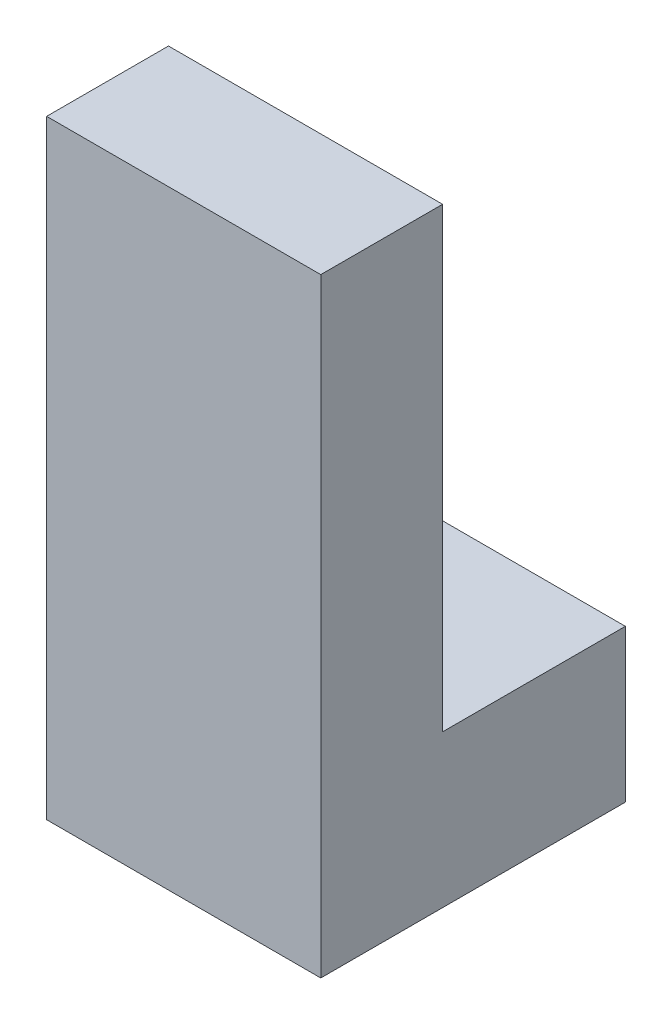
from build123d import *

# Parameters (mm, degrees)
SKETCH2_W           = 3.6
SKETCH2_H           = 4
BOSS_EXTRUDE1_DEPTH = 8
SKETCH4_W           = 3.6
SKETCH4_H           = 2.4
CUT_EXTRUDE2_DEPTH  = 6


with BuildPart() as part:
    # Sketch2 → Boss-Extrude1 (new body)
    with BuildSketch(Plane(origin=(0, 0, 0), x_dir=(1, 0, 0), z_dir=(0, 1, 0))):
        with Locations((1.8, 2)):
            Rectangle(SKETCH2_W, SKETCH2_H)
    extrude(amount=BOSS_EXTRUDE1_DEPTH)

    # Sketch4 → Cut-Extrude2 (cut)
    with BuildSketch(Plane(origin=(0, 8, 0), x_dir=(1, 0, 0), z_dir=(0, 1, 0))):
        with Locations((1.8, 2.8)):
            Rectangle(SKETCH4_W, SKETCH4_H)
    extrude(amount=-CUT_EXTRUDE2_DEPTH, mode=Mode.SUBTRACT)


solid = part.part
